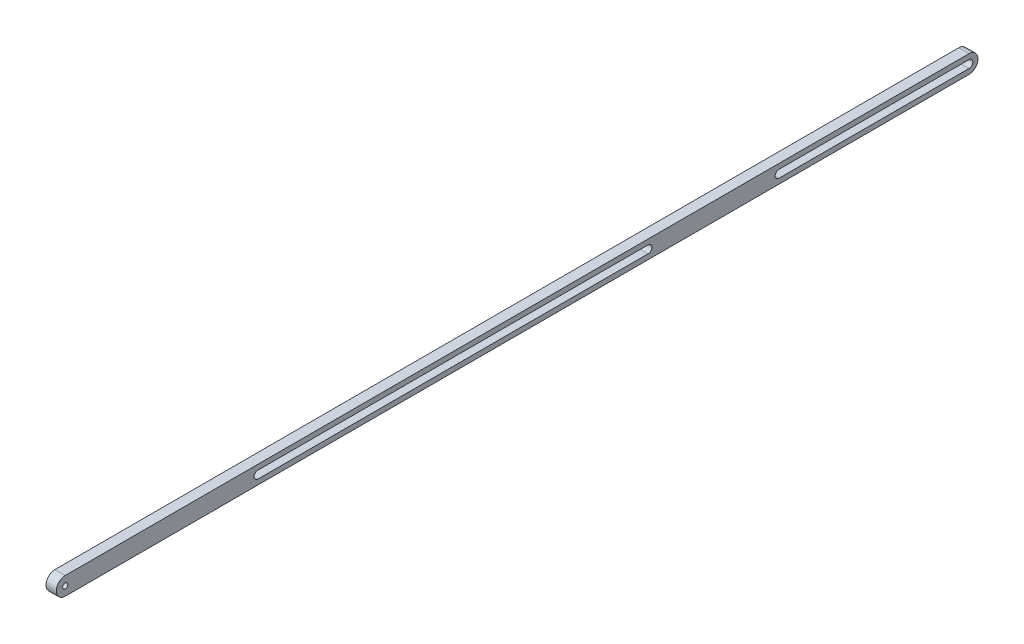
from build123d import *

# Parameters (mm, degrees)
SKETCH2_R           = 5
BOSS_EXTRUDE1_DEPTH = 20


with BuildPart() as part:
    # Sketch2 → Boss-Extrude1 (new body)
    with BuildSketch(Plane(origin=(0, 0, 0), x_dir=(0, 0, -1), z_dir=(1, 0, 0))):
        with BuildLine():
            Line((0, 17.5), (1760, 17.5))
            ThreePointArc((1760, 17.5), (1777.5, 0), (1760, -17.5))
            Line((1760, -17.5), (0, -17.5))
            ThreePointArc((0, -17.5), (-17.5, 0), (0, 17.5))
        make_face()
        Circle(SKETCH2_R, mode=Mode.SUBTRACT)
        with BuildLine():
            Line((375, 7.5), (1135, 7.5))
            ThreePointArc((1135, 7.5), (1142.5, 0), (1135, -7.5))
            Line((1135, -7.5), (375, -7.5))
            ThreePointArc((375, -7.5), (367.5, 0), (375, 7.5))
        make_face(mode=Mode.SUBTRACT)
        with BuildLine():
            Line((1760, -7.5), (1390, -7.5))
            ThreePointArc((1390, -7.5), (1382.5, 0), (1390, 7.5))
            Line((1390, 7.5), (1760, 7.5))
            ThreePointArc((1760, 7.5), (1767.5, 0), (1760, -7.5))
        make_face(mode=Mode.SUBTRACT)
    extrude(amount=BOSS_EXTRUDE1_DEPTH)


solid = part.part
